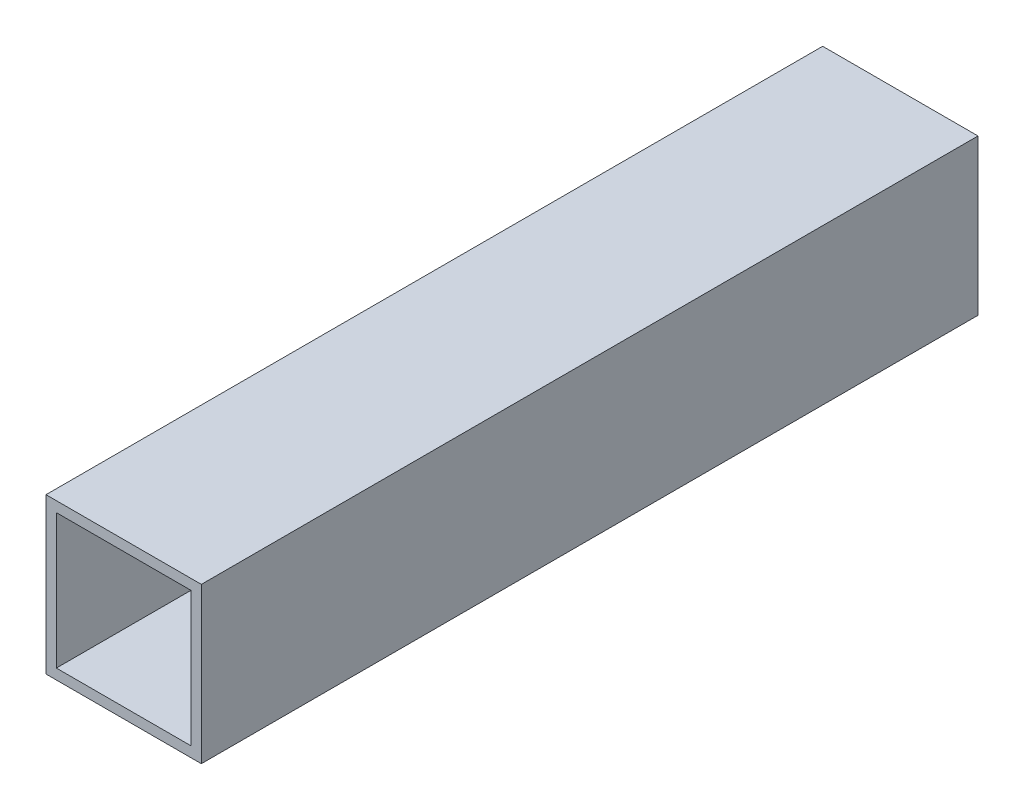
from build123d import *

# Parameters (mm, degrees)
ESQUISSE1_W        = 30
ESQUISSE1_H        = 30
ESQUISSE1_W_2      = 26
ESQUISSE1_H_2      = 26
EXTRU_MINCE1_DEPTH = 150


with BuildPart() as part:
    # Esquisse1 → Extru.-Mince1 (new body)
    with BuildSketch(Plane.XY):
        Rectangle(ESQUISSE1_W, ESQUISSE1_H)
        Rectangle(ESQUISSE1_W_2, ESQUISSE1_H_2, mode=Mode.SUBTRACT)
    extrude(amount=EXTRU_MINCE1_DEPTH)


solid = part.part
